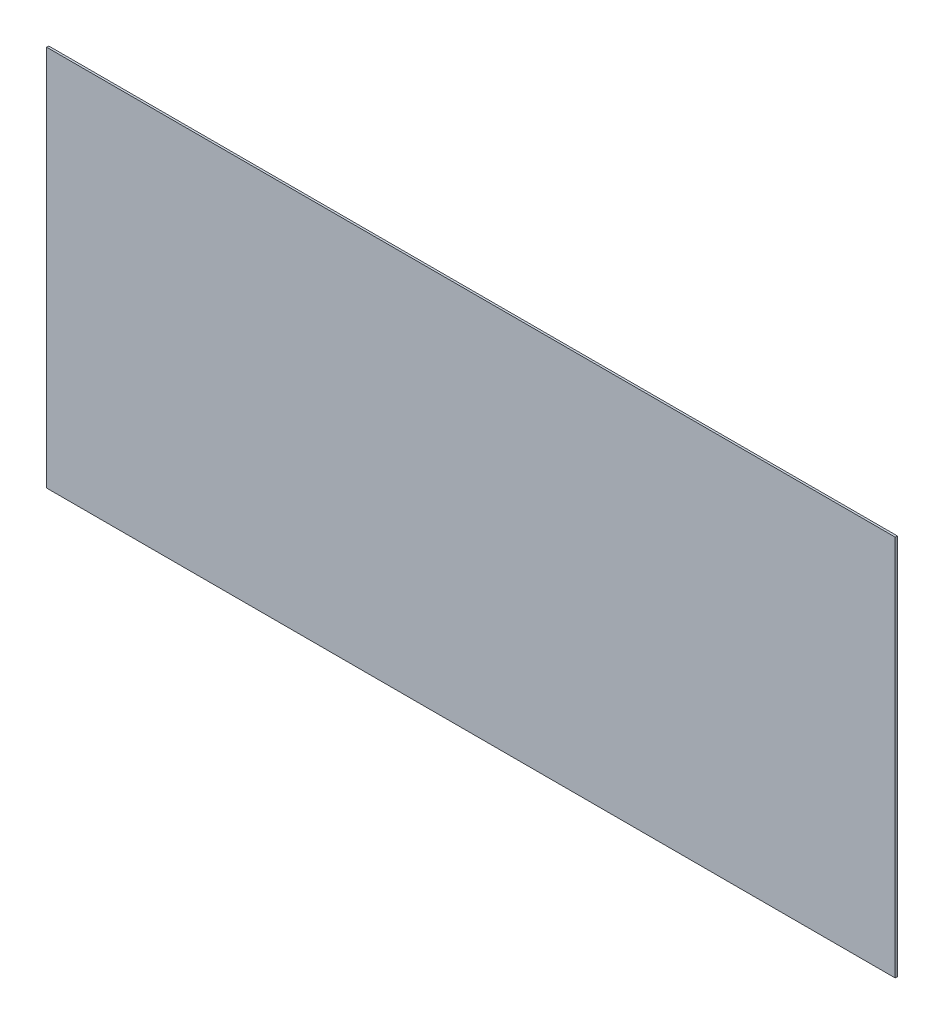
from build123d import *

# Parameters (mm, degrees)
ESQUISSE1_W      = 2000
ESQUISSE1_H      = 900
EXTRUSION1_DEPTH = 5


with BuildPart() as part:
    # Esquisse1 → Extrusion1 (new body)
    with BuildSketch(Plane.XY):
        with Locations((1000, 450)):
            Rectangle(ESQUISSE1_W, ESQUISSE1_H)
    extrude(amount=EXTRUSION1_DEPTH)


solid = part.part
